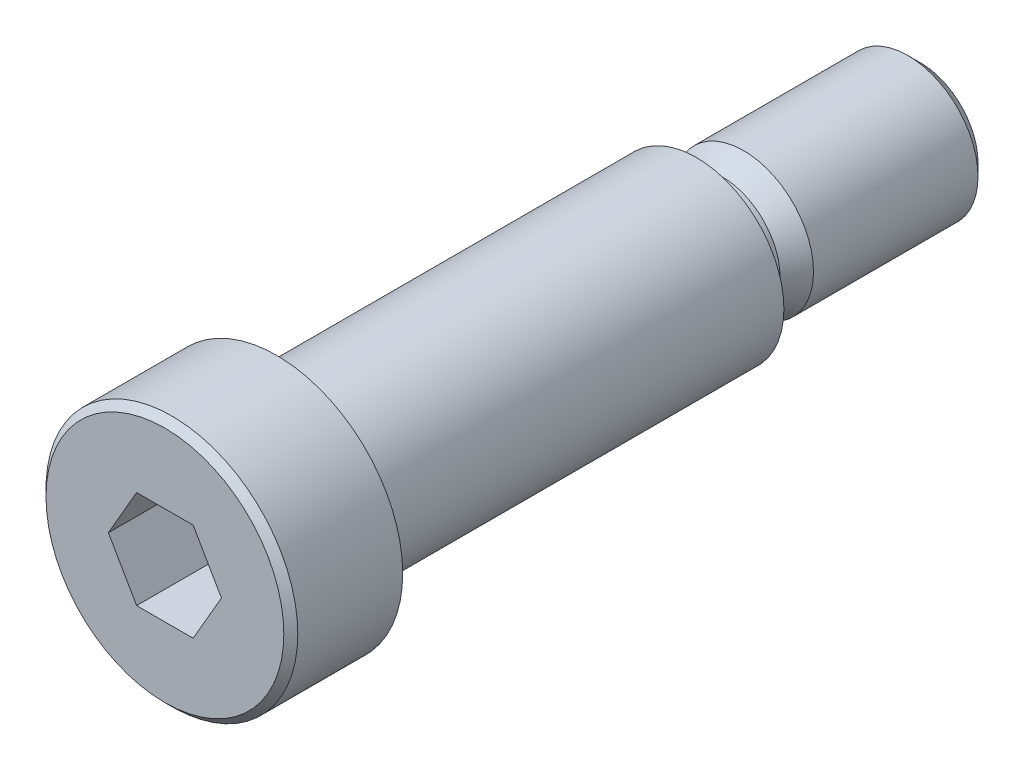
ISO-10303-21;
HEADER;
FILE_DESCRIPTION(('STEP AP214'),'2;1');
FILE_NAME('part.step','',(''),(''),'','','');
FILE_SCHEMA(('AUTOMOTIVE_DESIGN { 1 0 10303 214 1 1 1 1 }'));
ENDSEC;
DATA;
#1=APPLICATION_CONTEXT('core data for automotive mechanical design processes');
#2=APPLICATION_PROTOCOL_DEFINITION('international standard','automotive_design',2000,#1);
#3=PRODUCT_CONTEXT('',#1,'mechanical');
#4=PRODUCT('Part','Part','',(#3));
#5=PRODUCT_RELATED_PRODUCT_CATEGORY('part','',(#4));
#6=PRODUCT_DEFINITION_FORMATION('','',#4);
#7=PRODUCT_DEFINITION_CONTEXT('part definition',#1,'design');
#8=PRODUCT_DEFINITION('design','',#6,#7);
#9=PRODUCT_DEFINITION_SHAPE('','',#8);
#10=(LENGTH_UNIT() NAMED_UNIT(*) SI_UNIT(.MILLI.,.METRE.));
#11=(NAMED_UNIT(*) PLANE_ANGLE_UNIT() SI_UNIT($,.RADIAN.));
#12=(NAMED_UNIT(*) SI_UNIT($,.STERADIAN.) SOLID_ANGLE_UNIT());
#13=UNCERTAINTY_MEASURE_WITH_UNIT(LENGTH_MEASURE(1.E-05),#10,'distance_accuracy_value','');
#14=(GEOMETRIC_REPRESENTATION_CONTEXT(3) GLOBAL_UNCERTAINTY_ASSIGNED_CONTEXT((#13)) GLOBAL_UNIT_ASSIGNED_CONTEXT((#10,
#11,#12)) REPRESENTATION_CONTEXT('',''));
#15=CARTESIAN_POINT('',(0.,0.,0.));
#16=DIRECTION('',(0.,0.,1.));
#17=DIRECTION('',(1.,0.,0.));
#18=AXIS2_PLACEMENT_3D('',#15,#16,#17);
#19=CARTESIAN_POINT('',(0.,0.,16.));
#20=DIRECTION('',(0.,0.,1.));
#21=DIRECTION('',(1.,0.,0.));
#22=AXIS2_PLACEMENT_3D('',#19,#20,#21);
#23=PLANE('',#22);
#24=CARTESIAN_POINT('',(0.,0.,16.));
#25=DIRECTION('',(0.,0.,1.));
#26=DIRECTION('',(1.,0.,0.));
#27=AXIS2_PLACEMENT_3D('',#24,#25,#26);
#28=CIRCLE('',#27,17.);
#29=CARTESIAN_POINT('',(17.,0.,16.));
#30=VERTEX_POINT('',#29);
#31=EDGE_CURVE('E153',#30,#30,#28,.T.);
#32=ORIENTED_EDGE('',*,*,#31,.T.);
#33=EDGE_LOOP('',(#32));
#34=FACE_BOUND('',#33,.T.);
#35=DIRECTION('',(1.,0.,0.));
#36=VECTOR('',#35,1.);
#37=CARTESIAN_POINT('',(-4.04145,6.99999673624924,16.));
#38=LINE('',#37,#36);
#39=CARTESIAN_POINT('',(-4.04145,6.99999673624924,16.));
#40=VERTEX_POINT('',#39);
#41=CARTESIAN_POINT('',(4.04145,6.99999673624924,16.));
#42=VERTEX_POINT('',#41);
#43=EDGE_CURVE('E119',#40,#42,#38,.T.);
#44=ORIENTED_EDGE('',*,*,#43,.T.);
#45=DIRECTION('',(0.5,-0.866025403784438,0.));
#46=VECTOR('',#45,1.);
#47=CARTESIAN_POINT('',(4.04145,6.99999673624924,16.));
#48=LINE('',#47,#46);
#49=CARTESIAN_POINT('',(8.0829,0.,16.));
#50=VERTEX_POINT('',#49);
#51=EDGE_CURVE('E38',#42,#50,#48,.T.);
#52=ORIENTED_EDGE('',*,*,#51,.T.);
#53=DIRECTION('',(-0.5,-0.866025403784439,0.));
#54=VECTOR('',#53,1.);
#55=CARTESIAN_POINT('',(8.0829,0.,16.));
#56=LINE('',#55,#54);
#57=CARTESIAN_POINT('',(4.04145,-6.99999673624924,16.));
#58=VERTEX_POINT('',#57);
#59=EDGE_CURVE('E863',#50,#58,#56,.T.);
#60=ORIENTED_EDGE('',*,*,#59,.T.);
#61=DIRECTION('',(-1.,0.,0.));
#62=VECTOR('',#61,1.);
#63=CARTESIAN_POINT('',(4.04145,-6.99999673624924,16.));
#64=LINE('',#63,#62);
#65=CARTESIAN_POINT('',(-4.04145,-6.99999673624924,16.));
#66=VERTEX_POINT('',#65);
#67=EDGE_CURVE('E867',#58,#66,#64,.T.);
#68=ORIENTED_EDGE('',*,*,#67,.T.);
#69=DIRECTION('',(-0.5,0.866025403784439,0.));
#70=VECTOR('',#69,1.);
#71=CARTESIAN_POINT('',(-4.04145,-6.99999673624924,16.));
#72=LINE('',#71,#70);
#73=CARTESIAN_POINT('',(-8.0829,0.,16.));
#74=VERTEX_POINT('',#73);
#75=EDGE_CURVE('E871',#66,#74,#72,.T.);
#76=ORIENTED_EDGE('',*,*,#75,.T.);
#77=DIRECTION('',(0.5,0.866025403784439,0.));
#78=VECTOR('',#77,1.);
#79=CARTESIAN_POINT('',(-8.0829,0.,16.));
#80=LINE('',#79,#78);
#81=EDGE_CURVE('E126',#74,#40,#80,.T.);
#82=ORIENTED_EDGE('',*,*,#81,.T.);
#83=EDGE_LOOP('',(#44,#52,#60,#68,#76,#82));
#84=FACE_BOUND('',#83,.T.);
#85=ADVANCED_FACE('F17',(#34,#84),#23,.T.);
#86=CARTESIAN_POINT('',(0.,0.,-1.5625));
#87=DIRECTION('',(0.,0.,1.));
#88=DIRECTION('',(1.,0.,0.));
#89=AXIS2_PLACEMENT_3D('',#86,#87,#88);
#90=TOROIDAL_SURFACE('',#89,12.5,1.5625);
#91=CARTESIAN_POINT('',(0.,0.,0.));
#92=DIRECTION('',(0.,0.,1.));
#93=DIRECTION('',(1.,0.,0.));
#94=AXIS2_PLACEMENT_3D('',#91,#92,#93);
#95=CIRCLE('',#94,12.5);
#96=CARTESIAN_POINT('',(12.5,0.,0.));
#97=VERTEX_POINT('',#96);
#98=EDGE_CURVE('E141',#97,#97,#95,.T.);
#99=ORIENTED_EDGE('',*,*,#98,.F.);
#100=EDGE_LOOP('',(#99));
#101=FACE_BOUND('',#100,.T.);
#102=CARTESIAN_POINT('',(0.,0.,-3.125));
#103=DIRECTION('',(0.,0.,1.));
#104=DIRECTION('',(1.,0.,0.));
#105=AXIS2_PLACEMENT_3D('',#102,#103,#104);
#106=CIRCLE('',#105,12.5);
#107=CARTESIAN_POINT('',(12.5,0.,-3.125));
#108=VERTEX_POINT('',#107);
#109=EDGE_CURVE('E11',#108,#108,#106,.T.);
#110=ORIENTED_EDGE('',*,*,#109,.T.);
#111=EDGE_LOOP('',(#110));
#112=FACE_BOUND('',#111,.T.);
#113=ADVANCED_FACE('F19',(#101,#112),#90,.F.);
#114=CARTESIAN_POINT('',(0.,0.,16.));
#115=DIRECTION('',(0.,0.,1.));
#116=DIRECTION('',(1.,0.,0.));
#117=AXIS2_PLACEMENT_3D('',#114,#115,#116);
#118=CYLINDRICAL_SURFACE('',#117,12.5);
#119=CARTESIAN_POINT('',(0.,0.,-60.));
#120=DIRECTION('',(0.,0.,1.));
#121=DIRECTION('',(1.,0.,0.));
#122=AXIS2_PLACEMENT_3D('',#119,#120,#121);
#123=CIRCLE('',#122,12.5);
#124=CARTESIAN_POINT('',(12.5,0.,-60.));
#125=VERTEX_POINT('',#124);
#126=EDGE_CURVE('E26',#125,#125,#123,.T.);
#127=ORIENTED_EDGE('',*,*,#126,.T.);
#128=EDGE_LOOP('',(#127));
#129=FACE_BOUND('',#128,.T.);
#130=ORIENTED_EDGE('',*,*,#109,.F.);
#131=EDGE_LOOP('',(#130));
#132=FACE_BOUND('',#131,.T.);
#133=ADVANCED_FACE('F198',(#129,#132),#118,.T.);
#134=CARTESIAN_POINT('',(0.,-12.5,-60.));
#135=DIRECTION('',(0.,0.,-1.));
#136=DIRECTION('',(-1.,0.,0.));
#137=AXIS2_PLACEMENT_3D('',#134,#135,#136);
#138=PLANE('',#137);
#139=CARTESIAN_POINT('',(0.,0.,-60.));
#140=DIRECTION('',(0.,0.,1.));
#141=DIRECTION('',(1.,0.,0.));
#142=AXIS2_PLACEMENT_3D('',#139,#140,#141);
#143=CIRCLE('',#142,9.45);
#144=CARTESIAN_POINT('',(9.45,0.,-60.));
#145=VERTEX_POINT('',#144);
#146=EDGE_CURVE('E188',#145,#145,#143,.T.);
#147=ORIENTED_EDGE('',*,*,#146,.T.);
#148=EDGE_LOOP('',(#147));
#149=FACE_BOUND('',#148,.T.);
#150=ORIENTED_EDGE('',*,*,#126,.F.);
#151=EDGE_LOOP('',(#150));
#152=FACE_BOUND('',#151,.T.);
#153=ADVANCED_FACE('F201',(#149,#152),#138,.T.);
#154=CARTESIAN_POINT('',(0.,0.,-61.2));
#155=DIRECTION('',(0.,0.,1.));
#156=DIRECTION('',(1.,0.,0.));
#157=AXIS2_PLACEMENT_3D('',#154,#155,#156);
#158=TOROIDAL_SURFACE('',#157,9.45,1.2);
#159=ORIENTED_EDGE('',*,*,#146,.F.);
#160=EDGE_LOOP('',(#159));
#161=FACE_BOUND('',#160,.T.);
#162=CARTESIAN_POINT('',(0.,0.,-61.2));
#163=DIRECTION('',(0.,0.,1.));
#164=DIRECTION('',(1.,0.,0.));
#165=AXIS2_PLACEMENT_3D('',#162,#163,#164);
#166=CIRCLE('',#165,8.25);
#167=CARTESIAN_POINT('',(8.25000000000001,0.,-61.2));
#168=VERTEX_POINT('',#167);
#169=EDGE_CURVE('E184',#168,#168,#166,.T.);
#170=ORIENTED_EDGE('',*,*,#169,.T.);
#171=EDGE_LOOP('',(#170));
#172=FACE_BOUND('',#171,.T.);
#173=ADVANCED_FACE('F203',(#161,#172),#158,.F.);
#174=CARTESIAN_POINT('',(0.,0.,16.));
#175=DIRECTION('',(0.,0.,1.));
#176=DIRECTION('',(1.,0.,0.));
#177=AXIS2_PLACEMENT_3D('',#174,#175,#176);
#178=CYLINDRICAL_SURFACE('',#177,8.25);
#179=CARTESIAN_POINT('',(0.,0.,-63.7));
#180=DIRECTION('',(0.,0.,1.));
#181=DIRECTION('',(1.,0.,0.));
#182=AXIS2_PLACEMENT_3D('',#179,#180,#181);
#183=CIRCLE('',#182,8.25);
#184=CARTESIAN_POINT('',(8.25000000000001,0.,-63.7));
#185=VERTEX_POINT('',#184);
#186=EDGE_CURVE('E180',#185,#185,#183,.T.);
#187=ORIENTED_EDGE('',*,*,#186,.T.);
#188=EDGE_LOOP('',(#187));
#189=FACE_BOUND('',#188,.T.);
#190=ORIENTED_EDGE('',*,*,#169,.F.);
#191=EDGE_LOOP('',(#190));
#192=FACE_BOUND('',#191,.T.);
#193=ADVANCED_FACE('F212',(#189,#192),#178,.T.);
#194=CARTESIAN_POINT('',(0.,0.,-63.7));
#195=DIRECTION('',(0.,0.,-1.));
#196=DIRECTION('',(-1.,0.,0.));
#197=AXIS2_PLACEMENT_3D('',#194,#195,#196);
#198=CONICAL_SURFACE('',#197,8.25,0.523598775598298);
#199=CARTESIAN_POINT('',(0.,0.,-66.7310889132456));
#200=DIRECTION('',(0.,0.,1.));
#201=DIRECTION('',(1.,0.,0.));
#202=AXIS2_PLACEMENT_3D('',#199,#200,#201);
#203=CIRCLE('',#202,10.);
#204=CARTESIAN_POINT('',(10.,0.,-66.7310889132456));
#205=VERTEX_POINT('',#204);
#206=EDGE_CURVE('E176',#205,#205,#203,.T.);
#207=ORIENTED_EDGE('',*,*,#206,.T.);
#208=EDGE_LOOP('',(#207));
#209=FACE_BOUND('',#208,.T.);
#210=ORIENTED_EDGE('',*,*,#186,.F.);
#211=EDGE_LOOP('',(#210));
#212=FACE_BOUND('',#211,.T.);
#213=ADVANCED_FACE('F251',(#209,#212),#198,.T.);
#214=CARTESIAN_POINT('',(0.,0.,16.));
#215=DIRECTION('',(0.,0.,1.));
#216=DIRECTION('',(1.,0.,0.));
#217=AXIS2_PLACEMENT_3D('',#214,#215,#216);
#218=CYLINDRICAL_SURFACE('',#217,10.);
#219=CARTESIAN_POINT('',(0.,0.,-90.25));
#220=DIRECTION('',(0.,0.,1.));
#221=DIRECTION('',(1.,0.,0.));
#222=AXIS2_PLACEMENT_3D('',#219,#220,#221);
#223=CIRCLE('',#222,10.);
#224=CARTESIAN_POINT('',(10.,0.,-90.25));
#225=VERTEX_POINT('',#224);
#226=EDGE_CURVE('E172',#225,#225,#223,.T.);
#227=ORIENTED_EDGE('',*,*,#226,.T.);
#228=EDGE_LOOP('',(#227));
#229=FACE_BOUND('',#228,.T.);
#230=ORIENTED_EDGE('',*,*,#206,.F.);
#231=EDGE_LOOP('',(#230));
#232=FACE_BOUND('',#231,.T.);
#233=ADVANCED_FACE('F247',(#229,#232),#218,.T.);
#234=CARTESIAN_POINT('',(0.,0.,-90.25));
#235=DIRECTION('',(0.,0.,1.));
#236=DIRECTION('',(1.,0.,0.));
#237=AXIS2_PLACEMENT_3D('',#234,#235,#236);
#238=CONICAL_SURFACE('',#237,10.,0.785398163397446);
#239=CARTESIAN_POINT('',(0.,0.,-92.));
#240=DIRECTION('',(0.,0.,1.));
#241=DIRECTION('',(1.,0.,0.));
#242=AXIS2_PLACEMENT_3D('',#239,#240,#241);
#243=CIRCLE('',#242,8.25);
#244=CARTESIAN_POINT('',(8.25000000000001,0.,-92.));
#245=VERTEX_POINT('',#244);
#246=EDGE_CURVE('E168',#245,#245,#243,.T.);
#247=ORIENTED_EDGE('',*,*,#246,.T.);
#248=EDGE_LOOP('',(#247));
#249=FACE_BOUND('',#248,.T.);
#250=ORIENTED_EDGE('',*,*,#226,.F.);
#251=EDGE_LOOP('',(#250));
#252=FACE_BOUND('',#251,.T.);
#253=ADVANCED_FACE('F243',(#249,#252),#238,.T.);
#254=CARTESIAN_POINT('',(0.,-8.25,-92.));
#255=DIRECTION('',(0.,0.,-1.));
#256=DIRECTION('',(-1.,0.,0.));
#257=AXIS2_PLACEMENT_3D('',#254,#255,#256);
#258=PLANE('',#257);
#259=CARTESIAN_POINT('',(0.,0.,-92.));
#260=DIRECTION('',(0.,0.,1.));
#261=DIRECTION('',(1.,0.,0.));
#262=AXIS2_PLACEMENT_3D('',#259,#260,#261);
#263=CIRCLE('',#262,3.09079733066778);
#264=CARTESIAN_POINT('',(3.09079733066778,0.,-92.));
#265=VERTEX_POINT('',#264);
#266=EDGE_CURVE('E164',#265,#265,#263,.T.);
#267=ORIENTED_EDGE('',*,*,#266,.T.);
#268=EDGE_LOOP('',(#267));
#269=FACE_BOUND('',#268,.T.);
#270=ORIENTED_EDGE('',*,*,#246,.F.);
#271=EDGE_LOOP('',(#270));
#272=FACE_BOUND('',#271,.T.);
#273=ADVANCED_FACE('F239',(#269,#272),#258,.T.);
#274=CARTESIAN_POINT('',(0.,0.,-92.));
#275=DIRECTION('',(0.,0.,-1.));
#276=DIRECTION('',(-1.,0.,0.));
#277=AXIS2_PLACEMENT_3D('',#274,#275,#276);
#278=CONICAL_SURFACE('',#277,3.09079733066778,0.5235987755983);
#279=CARTESIAN_POINT('',(0.,0.,-89.5333333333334));
#280=DIRECTION('',(0.,0.,1.));
#281=DIRECTION('',(1.,0.,0.));
#282=AXIS2_PLACEMENT_3D('',#279,#280,#281);
#283=CIRCLE('',#282,1.66666666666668);
#284=CARTESIAN_POINT('',(1.66666666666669,0.,-89.5333333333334));
#285=VERTEX_POINT('',#284);
#286=EDGE_CURVE('E160',#285,#285,#283,.T.);
#287=ORIENTED_EDGE('',*,*,#286,.T.);
#288=EDGE_LOOP('',(#287));
#289=FACE_BOUND('',#288,.T.);
#290=ORIENTED_EDGE('',*,*,#266,.F.);
#291=EDGE_LOOP('',(#290));
#292=FACE_BOUND('',#291,.T.);
#293=ADVANCED_FACE('F235',(#289,#292),#278,.F.);
#294=CARTESIAN_POINT('',(0.,0.,16.));
#295=DIRECTION('',(0.,0.,1.));
#296=DIRECTION('',(1.,0.,0.));
#297=AXIS2_PLACEMENT_3D('',#294,#295,#296);
#298=CYLINDRICAL_SURFACE('',#297,1.66666666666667);
#299=CARTESIAN_POINT('',(0.,0.,-85.9399503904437));
#300=DIRECTION('',(0.,0.,1.));
#301=DIRECTION('',(1.,0.,0.));
#302=AXIS2_PLACEMENT_3D('',#299,#300,#301);
#303=CIRCLE('',#302,1.66666666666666);
#304=CARTESIAN_POINT('',(1.66666666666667,0.,-85.9399503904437));
#305=VERTEX_POINT('',#304);
#306=EDGE_CURVE('E156',#305,#305,#303,.T.);
#307=ORIENTED_EDGE('',*,*,#306,.T.);
#308=EDGE_LOOP('',(#307));
#309=FACE_BOUND('',#308,.T.);
#310=ORIENTED_EDGE('',*,*,#286,.F.);
#311=EDGE_LOOP('',(#310));
#312=FACE_BOUND('',#311,.T.);
#313=ADVANCED_FACE('F232',(#309,#312),#298,.F.);
#314=CARTESIAN_POINT('',(0.,0.,-85.9399503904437));
#315=DIRECTION('',(0.,0.,-1.));
#316=DIRECTION('',(-1.,0.,0.));
#317=AXIS2_PLACEMENT_3D('',#314,#315,#316);
#318=CONICAL_SURFACE('',#317,1.66666666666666,1.22173047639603);
#319=CARTESIAN_POINT('',(0.,0.,-85.3333333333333));
#320=VERTEX_POINT('',#319);
#321=VERTEX_LOOP('',#320);
#322=FACE_BOUND('',#321,.T.);
#323=ORIENTED_EDGE('',*,*,#306,.F.);
#324=EDGE_LOOP('',(#323));
#325=FACE_BOUND('',#324,.T.);
#326=ADVANCED_FACE('F229',(#322,#325),#318,.F.);
#327=CARTESIAN_POINT('',(0.,0.,16.));
#328=DIRECTION('',(0.,0.,-1.));
#329=DIRECTION('',(-1.,0.,0.));
#330=AXIS2_PLACEMENT_3D('',#327,#328,#329);
#331=CONICAL_SURFACE('',#330,17.,0.785398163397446);
#332=CARTESIAN_POINT('',(0.,0.,15.));
#333=DIRECTION('',(0.,0.,1.));
#334=DIRECTION('',(1.,0.,0.));
#335=AXIS2_PLACEMENT_3D('',#332,#333,#334);
#336=CIRCLE('',#335,18.);
#337=CARTESIAN_POINT('',(18.,0.,15.));
#338=VERTEX_POINT('',#337);
#339=EDGE_CURVE('E149',#338,#338,#336,.T.);
#340=ORIENTED_EDGE('',*,*,#339,.T.);
#341=EDGE_LOOP('',(#340));
#342=FACE_BOUND('',#341,.T.);
#343=ORIENTED_EDGE('',*,*,#31,.F.);
#344=EDGE_LOOP('',(#343));
#345=FACE_BOUND('',#344,.T.);
#346=ADVANCED_FACE('F227',(#342,#345),#331,.T.);
#347=CARTESIAN_POINT('',(0.,0.,16.));
#348=DIRECTION('',(0.,0.,1.));
#349=DIRECTION('',(1.,0.,0.));
#350=AXIS2_PLACEMENT_3D('',#347,#348,#349);
#351=CYLINDRICAL_SURFACE('',#350,18.);
#352=CARTESIAN_POINT('',(0.,0.,0.));
#353=DIRECTION('',(0.,0.,1.));
#354=DIRECTION('',(1.,0.,0.));
#355=AXIS2_PLACEMENT_3D('',#352,#353,#354);
#356=CIRCLE('',#355,18.);
#357=CARTESIAN_POINT('',(18.,0.,0.));
#358=VERTEX_POINT('',#357);
#359=EDGE_CURVE('E145',#358,#358,#356,.T.);
#360=ORIENTED_EDGE('',*,*,#359,.T.);
#361=EDGE_LOOP('',(#360));
#362=FACE_BOUND('',#361,.T.);
#363=ORIENTED_EDGE('',*,*,#339,.F.);
#364=EDGE_LOOP('',(#363));
#365=FACE_BOUND('',#364,.T.);
#366=ADVANCED_FACE('F321',(#362,#365),#351,.T.);
#367=CARTESIAN_POINT('',(0.,-18.,0.));
#368=DIRECTION('',(0.,0.,-1.));
#369=DIRECTION('',(-1.,0.,0.));
#370=AXIS2_PLACEMENT_3D('',#367,#368,#369);
#371=PLANE('',#370);
#372=ORIENTED_EDGE('',*,*,#98,.T.);
#373=EDGE_LOOP('',(#372));
#374=FACE_BOUND('',#373,.T.);
#375=ORIENTED_EDGE('',*,*,#359,.F.);
#376=EDGE_LOOP('',(#375));
#377=FACE_BOUND('',#376,.T.);
#378=ADVANCED_FACE('F330',(#374,#377),#371,.T.);
#379=CARTESIAN_POINT('',(4.04145,6.99999673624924,0.333335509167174));
#380=DIRECTION('',(-0.866025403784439,-0.5,0.));
#381=DIRECTION('',(-0.5,0.866025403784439,0.));
#382=AXIS2_PLACEMENT_3D('',#379,#380,#381);
#383=PLANE('',#382);
#384=DIRECTION('',(0.,0.,1.));
#385=VECTOR('',#384,1.);
#386=CARTESIAN_POINT('',(8.0829,0.,0.333335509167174));
#387=LINE('',#386,#385);
#388=CARTESIAN_POINT('',(8.0829,0.,5.));
#389=VERTEX_POINT('',#388);
#390=EDGE_CURVE('E138',#389,#50,#387,.T.);
#391=ORIENTED_EDGE('',*,*,#390,.T.);
#392=ORIENTED_EDGE('',*,*,#51,.F.);
#393=DIRECTION('',(0.,0.,1.));
#394=VECTOR('',#393,1.);
#395=CARTESIAN_POINT('',(4.04145,6.99999673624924,0.333335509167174));
#396=LINE('',#395,#394);
#397=CARTESIAN_POINT('',(4.04145,6.99999673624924,5.));
#398=VERTEX_POINT('',#397);
#399=EDGE_CURVE('E112',#398,#42,#396,.T.);
#400=ORIENTED_EDGE('',*,*,#399,.F.);
#401=CARTESIAN_POINT('',(8.08290115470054,-2.E-06,5.00000066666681));
#402=CARTESIAN_POINT('',(7.99406648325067,0.153864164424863,4.94872181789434));
#403=CARTESIAN_POINT('',(7.90490059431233,0.308304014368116,4.89977038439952));
#404=CARTESIAN_POINT('',(7.72584470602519,0.618437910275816,4.80716333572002));
#405=CARTESIAN_POINT('',(7.63595441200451,0.774132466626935,4.76351000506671));
#406=CARTESIAN_POINT('',(7.36484437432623,1.24370882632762,4.64135409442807));
#407=CARTESIAN_POINT('',(7.18255450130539,1.559444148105,4.57187428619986));
#408=CARTESIAN_POINT('',(6.90976104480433,2.03193627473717,4.49040295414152));
#409=CARTESIAN_POINT('',(6.82007246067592,2.18728145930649,4.46719451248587));
#410=CARTESIAN_POINT('',(6.64029009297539,2.49867365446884,4.42827826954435));
#411=CARTESIAN_POINT('',(6.55019634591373,2.6547206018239,4.41256980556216));
#412=CARTESIAN_POINT('',(6.36985242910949,2.96708542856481,4.38905385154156));
#413=CARTESIAN_POINT('',(6.27960255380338,3.12340279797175,4.38123739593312));
#414=CARTESIAN_POINT('',(6.0990244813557,3.43617319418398,4.37366467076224));
#415=CARTESIAN_POINT('',(6.00869628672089,3.59262621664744,4.37390815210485));
#416=CARTESIAN_POINT('',(5.76124184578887,4.02122988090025,4.38565325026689));
#417=CARTESIAN_POINT('',(5.60419664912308,4.29324014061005,4.4053603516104));
#418=CARTESIAN_POINT('',(5.29114930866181,4.83545403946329,4.46784506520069));
#419=CARTESIAN_POINT('',(5.13514826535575,5.10565577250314,4.51064402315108));
#420=CARTESIAN_POINT('',(4.82147120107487,5.64896038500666,4.61762637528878));
#421=CARTESIAN_POINT('',(4.66383474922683,5.92199472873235,4.68226292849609));
#422=CARTESIAN_POINT('',(4.35091230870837,6.46399229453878,4.82896081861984));
#423=CARTESIAN_POINT('',(4.19562231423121,6.73296245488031,4.91098770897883));
#424=CARTESIAN_POINT('',(4.04144884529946,6.99999873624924,5.00000066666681));
#425=B_SPLINE_CURVE_WITH_KNOTS('',3,(#401,#402,#403,#404,#405,#406,#407,#408,#409,#410,#411,
#412,#413,#414,#415,#416,#417,#418,#419,#420,#421,#422,#423,#424),.UNSPECIFIED.,.F.,.F.,(4,2,2,
2,2,2,2,2,2,2,2,4),(0.,0.554719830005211,1.10967801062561,2.22189997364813,2.76439031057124,
3.30683270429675,3.84865817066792,4.3904668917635,5.33360160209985,6.27760962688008,
7.24255125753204,8.20559910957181),.UNSPECIFIED.);
#426=EDGE_CURVE('E103',#389,#398,#425,.T.);
#427=ORIENTED_EDGE('',*,*,#426,.F.);
#428=EDGE_LOOP('',(#391,#392,#400,#427));
#429=FACE_BOUND('',#428,.T.);
#430=ADVANCED_FACE('F113',(#429),#383,.T.);
#431=CARTESIAN_POINT('',(8.0829,0.,0.333335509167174));
#432=DIRECTION('',(-0.866025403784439,0.5,0.));
#433=DIRECTION('',(0.5,0.866025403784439,0.));
#434=AXIS2_PLACEMENT_3D('',#431,#432,#433);
#435=PLANE('',#434);
#436=DIRECTION('',(0.,0.,1.));
#437=VECTOR('',#436,1.);
#438=CARTESIAN_POINT('',(4.04145,-6.99999673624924,0.333335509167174));
#439=LINE('',#438,#437);
#440=CARTESIAN_POINT('',(4.04145,-6.99999673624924,5.));
#441=VERTEX_POINT('',#440);
#442=EDGE_CURVE('E135',#441,#58,#439,.T.);
#443=ORIENTED_EDGE('',*,*,#442,.T.);
#444=ORIENTED_EDGE('',*,*,#59,.F.);
#445=ORIENTED_EDGE('',*,*,#390,.F.);
#446=CARTESIAN_POINT('',(4.04144884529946,-6.99999873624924,5.00000066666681));
#447=CARTESIAN_POINT('',(4.13028351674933,-6.84613257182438,4.94872181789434));
#448=CARTESIAN_POINT('',(4.21944940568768,-6.69169272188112,4.89977038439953));
#449=CARTESIAN_POINT('',(4.39850529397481,-6.38155882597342,4.80716333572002));
#450=CARTESIAN_POINT('',(4.48839558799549,-6.2258642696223,4.76351000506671));
#451=CARTESIAN_POINT('',(4.75950562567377,-5.75628790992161,4.64135409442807));
#452=CARTESIAN_POINT('',(4.94179549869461,-5.44055258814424,4.57187428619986));
#453=CARTESIAN_POINT('',(5.21458895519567,-4.96806046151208,4.49040295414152));
#454=CARTESIAN_POINT('',(5.30427753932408,-4.81271527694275,4.46719451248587));
#455=CARTESIAN_POINT('',(5.48405990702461,-4.5013230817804,4.42827826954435));
#456=CARTESIAN_POINT('',(5.57415365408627,-4.34527613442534,4.41256980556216));
#457=CARTESIAN_POINT('',(5.75449757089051,-4.03291130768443,4.38905385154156));
#458=CARTESIAN_POINT('',(5.84474744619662,-3.87659393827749,4.38123739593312));
#459=CARTESIAN_POINT('',(6.0253255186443,-3.56382354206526,4.37366467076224));
#460=CARTESIAN_POINT('',(6.11565371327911,-3.4073705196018,4.37390815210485));
#461=CARTESIAN_POINT('',(6.36310815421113,-2.97876685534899,4.38565325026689));
#462=CARTESIAN_POINT('',(6.52015335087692,-2.70675659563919,4.4053603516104));
#463=CARTESIAN_POINT('',(6.83320069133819,-2.16454269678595,4.46784506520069));
#464=CARTESIAN_POINT('',(6.98920173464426,-1.8943409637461,4.51064402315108));
#465=CARTESIAN_POINT('',(7.30287879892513,-1.35103635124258,4.61762637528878));
#466=CARTESIAN_POINT('',(7.46051525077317,-1.07800200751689,4.68226292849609));
#467=CARTESIAN_POINT('',(7.77343769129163,-0.536004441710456,4.82896081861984));
#468=CARTESIAN_POINT('',(7.92872768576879,-0.267034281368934,4.91098770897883));
#469=CARTESIAN_POINT('',(8.08290115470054,1.99999999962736E-06,5.00000066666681));
#470=B_SPLINE_CURVE_WITH_KNOTS('',3,(#446,#447,#448,#449,#450,#451,#452,#453,#454,#455,#456,
#457,#458,#459,#460,#461,#462,#463,#464,#465,#466,#467,#468,#469),.UNSPECIFIED.,.F.,.F.,(4,2,2,
2,2,2,2,2,2,2,2,4),(0.,0.554719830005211,1.10967801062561,2.22189997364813,2.76439031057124,
3.30683270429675,3.84865817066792,4.39046689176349,5.33360160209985,6.27760962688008,
7.24255125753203,8.20559910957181),.UNSPECIFIED.);
#471=EDGE_CURVE('E108',#441,#389,#470,.T.);
#472=ORIENTED_EDGE('',*,*,#471,.F.);
#473=EDGE_LOOP('',(#443,#444,#445,#472));
#474=FACE_BOUND('',#473,.T.);
#475=ADVANCED_FACE('F348',(#474),#435,.T.);
#476=CARTESIAN_POINT('',(4.04145,-6.99999673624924,0.333335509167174));
#477=DIRECTION('',(0.,1.,0.));
#478=DIRECTION('',(1.,0.,0.));
#479=AXIS2_PLACEMENT_3D('',#476,#477,#478);
#480=PLANE('',#479);
#481=DIRECTION('',(0.,0.,1.));
#482=VECTOR('',#481,1.);
#483=CARTESIAN_POINT('',(-4.04145,-6.99999673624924,0.333335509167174));
#484=LINE('',#483,#482);
#485=CARTESIAN_POINT('',(-4.04145,-6.99999673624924,5.));
#486=VERTEX_POINT('',#485);
#487=EDGE_CURVE('E132',#486,#66,#484,.T.);
#488=ORIENTED_EDGE('',*,*,#487,.T.);
#489=ORIENTED_EDGE('',*,*,#67,.F.);
#490=ORIENTED_EDGE('',*,*,#442,.F.);
#491=CARTESIAN_POINT('',(-10.4660109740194,-6.99999673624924,7.60284580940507));
#492=CARTESIAN_POINT('',(-10.1637269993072,-6.99999673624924,7.45782139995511));
#493=CARTESIAN_POINT('',(-9.86070662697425,-6.99999673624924,7.31430332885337));
#494=CARTESIAN_POINT('',(-9.2528005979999,-6.99999673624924,7.03113439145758));
#495=CARTESIAN_POINT('',(-8.94791461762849,-6.99999673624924,6.89148422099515));
#496=CARTESIAN_POINT('',(-8.33413673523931,-6.99999673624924,6.61612544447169));
#497=CARTESIAN_POINT('',(-8.02523175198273,-6.99999673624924,6.48044588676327));
#498=CARTESIAN_POINT('',(-7.40482970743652,-6.99999673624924,6.21517096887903));
#499=CARTESIAN_POINT('',(-7.09333278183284,-6.99999673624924,6.08557529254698));
#500=CARTESIAN_POINT('',(-6.4590456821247,-6.99999673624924,5.83078821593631));
#501=CARTESIAN_POINT('',(-6.13617317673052,-6.99999673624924,5.70580055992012));
#502=CARTESIAN_POINT('',(-5.48652368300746,-6.99999673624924,5.46621670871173));
#503=CARTESIAN_POINT('',(-5.15974624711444,-6.99999673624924,5.35162171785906));
#504=CARTESIAN_POINT('',(-4.50250315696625,-6.99999673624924,5.13609609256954));
#505=CARTESIAN_POINT('',(-4.17204779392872,-6.99999673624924,5.03513443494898));
#506=CARTESIAN_POINT('',(-3.50644237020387,-6.99999673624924,4.85034034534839));
#507=CARTESIAN_POINT('',(-3.17129392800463,-6.99999673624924,4.76650215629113));
#508=CARTESIAN_POINT('',(-2.49689993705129,-6.99999673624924,4.6204180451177));
#509=CARTESIAN_POINT('',(-2.15766406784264,-6.99999673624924,4.55812870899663));
#510=CARTESIAN_POINT('',(-1.64604254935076,-6.99999673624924,4.48392112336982));
#511=CARTESIAN_POINT('',(-1.47502545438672,-6.99999673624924,4.46238860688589));
#512=CARTESIAN_POINT('',(-1.13227399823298,-6.99999673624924,4.42616029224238));
#513=CARTESIAN_POINT('',(-0.960539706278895,-6.99999673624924,4.41146384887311));
#514=CARTESIAN_POINT('',(-0.618654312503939,-6.99999673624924,4.38936696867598));
#515=CARTESIAN_POINT('',(-0.448508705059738,-6.99999673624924,4.38188174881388));
#516=CARTESIAN_POINT('',(-0.108054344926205,-6.99999673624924,4.37407394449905));
#517=CARTESIAN_POINT('',(0.0622544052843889,-6.99999673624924,4.37375125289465));
#518=CARTESIAN_POINT('',(0.402740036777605,-6.99999673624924,4.3802769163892));
#519=CARTESIAN_POINT('',(0.572916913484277,-6.99999673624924,4.38712551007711));
#520=CARTESIAN_POINT('',(0.912846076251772,-6.99999673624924,4.40783579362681));
#521=CARTESIAN_POINT('',(1.082598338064,-6.99999673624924,4.42169787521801));
#522=CARTESIAN_POINT('',(1.50233038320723,-6.99999673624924,4.46436831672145));
#523=CARTESIAN_POINT('',(1.75191207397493,-6.99999673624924,4.49715292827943));
#524=CARTESIAN_POINT('',(2.2489711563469,-6.99999673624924,4.57600137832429));
#525=CARTESIAN_POINT('',(2.49644820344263,-6.99999673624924,4.62206734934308));
#526=CARTESIAN_POINT('',(2.98914518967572,-6.99999673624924,4.72583921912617));
#527=CARTESIAN_POINT('',(3.23436304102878,-6.99999673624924,4.78355493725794));
#528=CARTESIAN_POINT('',(3.72222383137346,-6.99999673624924,4.90889246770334));
#529=CARTESIAN_POINT('',(3.96486683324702,-6.99999673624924,4.97651403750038));
#530=CARTESIAN_POINT('',(4.45307336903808,-6.99999673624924,5.12169118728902));
#531=CARTESIAN_POINT('',(4.69858039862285,-6.99999673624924,5.19943551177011));
#532=CARTESIAN_POINT('',(5.18717546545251,-6.99999673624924,5.36214979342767));
#533=CARTESIAN_POINT('',(5.43026348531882,-6.99999673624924,5.44711980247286));
#534=CARTESIAN_POINT('',(5.91415786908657,-6.99999673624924,5.62300757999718));
#535=CARTESIAN_POINT('',(6.15496511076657,-6.99999673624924,5.713922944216));
#536=CARTESIAN_POINT('',(6.63463640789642,-6.99999673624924,5.90071172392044));
#537=CARTESIAN_POINT('',(6.87350049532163,-6.99999673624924,5.99658505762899));
#538=CARTESIAN_POINT('',(7.483230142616,-6.99999673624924,6.24745784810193));
#539=CARTESIAN_POINT('',(7.85287588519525,-6.99999673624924,6.40541911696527));
#540=CARTESIAN_POINT('',(8.58883735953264,-6.99999673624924,6.72894016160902));
#541=CARTESIAN_POINT('',(8.95515283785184,-6.99999673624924,6.89450050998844));
#542=CARTESIAN_POINT('',(9.68517373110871,-6.99999673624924,7.23151164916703));
#543=CARTESIAN_POINT('',(10.048878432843,-6.99999673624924,7.40296398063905));
#544=CARTESIAN_POINT('',(10.77408344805,-6.99999673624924,7.75043152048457));
#545=CARTESIAN_POINT('',(11.1355838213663,-6.99999673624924,7.92644660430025));
#546=CARTESIAN_POINT('',(11.8572308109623,-6.99999673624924,8.28231073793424));
#547=CARTESIAN_POINT('',(12.2173752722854,-6.99999673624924,8.46216415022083));
#548=CARTESIAN_POINT('',(12.9361904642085,-6.99999673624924,8.82479253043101));
#549=CARTESIAN_POINT('',(13.2948611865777,-6.99999673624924,9.00756751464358));
#550=CARTESIAN_POINT('',(14.3689456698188,-6.99999673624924,9.55937103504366));
#551=CARTESIAN_POINT('',(15.0825432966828,-6.99999673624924,9.93193360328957));
#552=CARTESIAN_POINT('',(16.4391457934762,-6.99999673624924,10.6480147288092));
#553=CARTESIAN_POINT('',(17.0824567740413,-6.99999673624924,10.9909558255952));
#554=CARTESIAN_POINT('',(18.3670121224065,-6.99999673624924,11.6807499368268));
#555=CARTESIAN_POINT('',(19.0082564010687,-6.99999673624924,12.0276031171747));
#556=CARTESIAN_POINT('',(20.2875218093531,-6.99999673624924,12.7233504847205));
#557=CARTESIAN_POINT('',(20.9255469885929,-6.99999673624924,13.072237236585));
#558=CARTESIAN_POINT('',(22.2003039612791,-6.99999673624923,13.7722796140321));
#559=CARTESIAN_POINT('',(22.837035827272,-6.99999673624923,14.1234351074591));
#560=CARTESIAN_POINT('',(23.4733041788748,-6.99999673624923,14.4754235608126));
#561=B_SPLINE_CURVE_WITH_KNOTS('',3,(#491,#492,#493,#494,#495,#496,#497,#498,#499,#500,#501,
#502,#503,#504,#505,#506,#507,#508,#509,#510,#511,#512,#513,#514,#515,#516,#517,#518,#519,#520,
#521,#522,#523,#524,#525,#526,#527,#528,#529,#530,#531,#532,#533,#534,#535,#536,#537,#538,#539,
#540,#541,#542,#543,#544,#545,#546,#547,#548,#549,#550,#551,#552,#553,#554,#555,#556,#557,#558,
#559,#560),.UNSPECIFIED.,.F.,.F.,(4,2,2,2,2,2,2,2,2,2,2,2,2,2,2,2,2,2,2,2,2,2,2,2,2,2,2,2,2,2,2,
2,2,2,4),(0.,1.00583192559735,2.01184363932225,3.02395785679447,4.03601942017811,
5.07454204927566,6.11318487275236,7.14942289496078,8.18531194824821,9.21910169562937,
9.73608835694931,10.2530262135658,10.7638094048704,11.2745849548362,11.7853774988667,
12.2961985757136,13.0509501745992,13.8058230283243,14.5613348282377,15.3168281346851,
16.0892611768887,16.8616997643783,17.6338278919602,18.4059432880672,19.6117659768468,
20.817679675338,22.0239111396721,23.2301097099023,24.4377610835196,25.6454191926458,
28.0603617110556,30.2473818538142,32.4344950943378,34.6160453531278,36.7974696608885),.UNSPECIFIED.);
#562=EDGE_CURVE('E816',#486,#441,#561,.T.);
#563=ORIENTED_EDGE('',*,*,#562,.F.);
#564=EDGE_LOOP('',(#488,#489,#490,#563));
#565=FACE_BOUND('',#564,.T.);
#566=ADVANCED_FACE('F357',(#565),#480,.T.);
#567=CARTESIAN_POINT('',(-4.04145,-6.99999673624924,0.333335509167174));
#568=DIRECTION('',(0.866025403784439,0.5,0.));
#569=DIRECTION('',(0.5,-0.866025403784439,0.));
#570=AXIS2_PLACEMENT_3D('',#567,#568,#569);
#571=PLANE('',#570);
#572=DIRECTION('',(0.,0.,1.));
#573=VECTOR('',#572,1.);
#574=CARTESIAN_POINT('',(-8.0829,0.,0.333335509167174));
#575=LINE('',#574,#573);
#576=CARTESIAN_POINT('',(-8.0829,0.,5.));
#577=VERTEX_POINT('',#576);
#578=EDGE_CURVE('E123',#577,#74,#575,.T.);
#579=ORIENTED_EDGE('',*,*,#578,.T.);
#580=ORIENTED_EDGE('',*,*,#75,.F.);
#581=ORIENTED_EDGE('',*,*,#487,.F.);
#582=CARTESIAN_POINT('',(-8.08290115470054,1.99999999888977E-06,5.00000066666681));
#583=CARTESIAN_POINT('',(-7.99406648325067,-0.153864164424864,4.94872181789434));
#584=CARTESIAN_POINT('',(-7.90490059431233,-0.308304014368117,4.89977038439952));
#585=CARTESIAN_POINT('',(-7.72584470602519,-0.618437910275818,4.80716333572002));
#586=CARTESIAN_POINT('',(-7.63595441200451,-0.774132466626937,4.76351000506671));
#587=CARTESIAN_POINT('',(-7.36484437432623,-1.24370882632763,4.64135409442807));
#588=CARTESIAN_POINT('',(-7.18255450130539,-1.559444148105,4.57187428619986));
#589=CARTESIAN_POINT('',(-6.90976104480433,-2.03193627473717,4.49040295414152));
#590=CARTESIAN_POINT('',(-6.82007246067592,-2.18728145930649,4.46719451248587));
#591=CARTESIAN_POINT('',(-6.64029009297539,-2.49867365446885,4.42827826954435));
#592=CARTESIAN_POINT('',(-6.55019634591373,-2.6547206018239,4.41256980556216));
#593=CARTESIAN_POINT('',(-6.36985242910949,-2.96708542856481,4.38905385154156));
#594=CARTESIAN_POINT('',(-6.27960255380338,-3.12340279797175,4.38123739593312));
#595=CARTESIAN_POINT('',(-6.0990244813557,-3.43617319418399,4.37366467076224));
#596=CARTESIAN_POINT('',(-6.00869628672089,-3.59262621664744,4.37390815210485));
#597=CARTESIAN_POINT('',(-5.76124184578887,-4.02122988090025,4.38565325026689));
#598=CARTESIAN_POINT('',(-5.60419664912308,-4.29324014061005,4.4053603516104));
#599=CARTESIAN_POINT('',(-5.29114930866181,-4.83545403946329,4.46784506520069));
#600=CARTESIAN_POINT('',(-5.13514826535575,-5.10565577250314,4.51064402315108));
#601=CARTESIAN_POINT('',(-4.82147120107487,-5.64896038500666,4.61762637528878));
#602=CARTESIAN_POINT('',(-4.66383474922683,-5.92199472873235,4.68226292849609));
#603=CARTESIAN_POINT('',(-4.35091230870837,-6.46399229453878,4.82896081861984));
#604=CARTESIAN_POINT('',(-4.19562231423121,-6.73296245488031,4.91098770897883));
#605=CARTESIAN_POINT('',(-4.04144884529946,-6.99999873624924,5.00000066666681));
#606=B_SPLINE_CURVE_WITH_KNOTS('',3,(#582,#583,#584,#585,#586,#587,#588,#589,#590,#591,#592,
#593,#594,#595,#596,#597,#598,#599,#600,#601,#602,#603,#604,#605),.UNSPECIFIED.,.F.,.F.,(4,2,2,
2,2,2,2,2,2,2,2,4),(0.,0.554719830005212,1.10967801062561,2.22189997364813,2.76439031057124,
3.30683270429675,3.84865817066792,4.39046689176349,5.33360160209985,6.27760962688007,
7.24255125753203,8.20559910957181),.UNSPECIFIED.);
#607=EDGE_CURVE('E821',#577,#486,#606,.T.);
#608=ORIENTED_EDGE('',*,*,#607,.F.);
#609=EDGE_LOOP('',(#579,#580,#581,#608));
#610=FACE_BOUND('',#609,.T.);
#611=ADVANCED_FACE('F367',(#610),#571,.T.);
#612=CARTESIAN_POINT('',(-8.0829,0.,0.333335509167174));
#613=DIRECTION('',(0.866025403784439,-0.5,0.));
#614=DIRECTION('',(-0.5,-0.866025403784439,0.));
#615=AXIS2_PLACEMENT_3D('',#612,#613,#614);
#616=PLANE('',#615);
#617=DIRECTION('',(0.,0.,1.));
#618=VECTOR('',#617,1.);
#619=CARTESIAN_POINT('',(-4.04145,6.99999673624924,0.333335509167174));
#620=LINE('',#619,#618);
#621=CARTESIAN_POINT('',(-4.04145,6.99999673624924,5.));
#622=VERTEX_POINT('',#621);
#623=EDGE_CURVE('E118',#622,#40,#620,.T.);
#624=ORIENTED_EDGE('',*,*,#623,.T.);
#625=ORIENTED_EDGE('',*,*,#81,.F.);
#626=ORIENTED_EDGE('',*,*,#578,.F.);
#627=CARTESIAN_POINT('',(-4.04144884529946,6.99999873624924,5.00000066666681));
#628=CARTESIAN_POINT('',(-4.13028351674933,6.84613257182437,4.94872181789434));
#629=CARTESIAN_POINT('',(-4.21944940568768,6.69169272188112,4.89977038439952));
#630=CARTESIAN_POINT('',(-4.39850529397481,6.38155882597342,4.80716333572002));
#631=CARTESIAN_POINT('',(-4.48839558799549,6.2258642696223,4.76351000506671));
#632=CARTESIAN_POINT('',(-4.75950562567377,5.75628790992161,4.64135409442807));
#633=CARTESIAN_POINT('',(-4.94179549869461,5.44055258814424,4.57187428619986));
#634=CARTESIAN_POINT('',(-5.21458895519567,4.96806046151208,4.49040295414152));
#635=CARTESIAN_POINT('',(-5.30427753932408,4.81271527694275,4.46719451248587));
#636=CARTESIAN_POINT('',(-5.48405990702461,4.5013230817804,4.42827826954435));
#637=CARTESIAN_POINT('',(-5.57415365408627,4.34527613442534,4.41256980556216));
#638=CARTESIAN_POINT('',(-5.75449757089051,4.03291130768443,4.38905385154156));
#639=CARTESIAN_POINT('',(-5.84474744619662,3.87659393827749,4.38123739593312));
#640=CARTESIAN_POINT('',(-6.0253255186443,3.56382354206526,4.37366467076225));
#641=CARTESIAN_POINT('',(-6.11565371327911,3.4073705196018,4.37390815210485));
#642=CARTESIAN_POINT('',(-6.36310815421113,2.97876685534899,4.38565325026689));
#643=CARTESIAN_POINT('',(-6.52015335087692,2.70675659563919,4.4053603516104));
#644=CARTESIAN_POINT('',(-6.83320069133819,2.16454269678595,4.46784506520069));
#645=CARTESIAN_POINT('',(-6.98920173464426,1.8943409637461,4.51064402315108));
#646=CARTESIAN_POINT('',(-7.30287879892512,1.35103635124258,4.61762637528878));
#647=CARTESIAN_POINT('',(-7.46051525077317,1.07800200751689,4.68226292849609));
#648=CARTESIAN_POINT('',(-7.77343769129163,0.536004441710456,4.82896081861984));
#649=CARTESIAN_POINT('',(-7.92872768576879,0.267034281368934,4.91098770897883));
#650=CARTESIAN_POINT('',(-8.08290115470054,-1.99999999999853E-06,5.00000066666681));
#651=B_SPLINE_CURVE_WITH_KNOTS('',3,(#627,#628,#629,#630,#631,#632,#633,#634,#635,#636,#637,
#638,#639,#640,#641,#642,#643,#644,#645,#646,#647,#648,#649,#650),.UNSPECIFIED.,.F.,.F.,(4,2,2,
2,2,2,2,2,2,2,2,4),(0.,0.554719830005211,1.10967801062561,2.22189997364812,2.76439031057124,
3.30683270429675,3.84865817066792,4.39046689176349,5.33360160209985,6.27760962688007,
7.24255125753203,8.20559910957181),.UNSPECIFIED.);
#652=EDGE_CURVE('E824',#622,#577,#651,.T.);
#653=ORIENTED_EDGE('',*,*,#652,.F.);
#654=EDGE_LOOP('',(#624,#625,#626,#653));
#655=FACE_BOUND('',#654,.T.);
#656=ADVANCED_FACE('F377',(#655),#616,.T.);
#657=CARTESIAN_POINT('',(-4.04145,6.99999673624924,0.333335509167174));
#658=DIRECTION('',(0.,-1.,0.));
#659=DIRECTION('',(-1.,0.,0.));
#660=AXIS2_PLACEMENT_3D('',#657,#658,#659);
#661=PLANE('',#660);
#662=ORIENTED_EDGE('',*,*,#399,.T.);
#663=ORIENTED_EDGE('',*,*,#43,.F.);
#664=ORIENTED_EDGE('',*,*,#623,.F.);
#665=CARTESIAN_POINT('',(-10.4660109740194,6.99999673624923,7.60284580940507));
#666=CARTESIAN_POINT('',(-10.1637269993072,6.99999673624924,7.45782139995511));
#667=CARTESIAN_POINT('',(-9.86070662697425,6.99999673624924,7.31430332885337));
#668=CARTESIAN_POINT('',(-9.2528005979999,6.99999673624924,7.03113439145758));
#669=CARTESIAN_POINT('',(-8.94791461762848,6.99999673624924,6.89148422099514));
#670=CARTESIAN_POINT('',(-8.33413673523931,6.99999673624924,6.61612544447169));
#671=CARTESIAN_POINT('',(-8.02523175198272,6.99999673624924,6.48044588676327));
#672=CARTESIAN_POINT('',(-7.40482970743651,6.99999673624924,6.21517096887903));
#673=CARTESIAN_POINT('',(-7.09333278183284,6.99999673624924,6.08557529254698));
#674=CARTESIAN_POINT('',(-6.4590456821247,6.99999673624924,5.8307882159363));
#675=CARTESIAN_POINT('',(-6.13617317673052,6.99999673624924,5.70580055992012));
#676=CARTESIAN_POINT('',(-5.48652368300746,6.99999673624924,5.46621670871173));
#677=CARTESIAN_POINT('',(-5.15974624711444,6.99999673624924,5.35162171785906));
#678=CARTESIAN_POINT('',(-4.50250315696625,6.99999673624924,5.13609609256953));
#679=CARTESIAN_POINT('',(-4.17204779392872,6.99999673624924,5.03513443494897));
#680=CARTESIAN_POINT('',(-3.50644237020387,6.99999673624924,4.85034034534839));
#681=CARTESIAN_POINT('',(-3.17129392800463,6.99999673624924,4.76650215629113));
#682=CARTESIAN_POINT('',(-2.49689993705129,6.99999673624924,4.6204180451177));
#683=CARTESIAN_POINT('',(-2.15766406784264,6.99999673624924,4.55812870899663));
#684=CARTESIAN_POINT('',(-1.64604254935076,6.99999673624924,4.48392112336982));
#685=CARTESIAN_POINT('',(-1.47502545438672,6.99999673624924,4.46238860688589));
#686=CARTESIAN_POINT('',(-1.13227399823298,6.99999673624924,4.42616029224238));
#687=CARTESIAN_POINT('',(-0.960539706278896,6.99999673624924,4.41146384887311));
#688=CARTESIAN_POINT('',(-0.618654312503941,6.99999673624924,4.38936696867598));
#689=CARTESIAN_POINT('',(-0.44850870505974,6.99999673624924,4.38188174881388));
#690=CARTESIAN_POINT('',(-0.108054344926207,6.99999673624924,4.37407394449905));
#691=CARTESIAN_POINT('',(0.0622544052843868,6.99999673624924,4.37375125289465));
#692=CARTESIAN_POINT('',(0.402740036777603,6.99999673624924,4.3802769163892));
#693=CARTESIAN_POINT('',(0.572916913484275,6.99999673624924,4.38712551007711));
#694=CARTESIAN_POINT('',(0.91284607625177,6.99999673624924,4.40783579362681));
#695=CARTESIAN_POINT('',(1.082598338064,6.99999673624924,4.42169787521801));
#696=CARTESIAN_POINT('',(1.50233038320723,6.99999673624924,4.46436831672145));
#697=CARTESIAN_POINT('',(1.75191207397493,6.99999673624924,4.49715292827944));
#698=CARTESIAN_POINT('',(2.2489711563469,6.99999673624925,4.57600137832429));
#699=CARTESIAN_POINT('',(2.49644820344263,6.99999673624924,4.62206734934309));
#700=CARTESIAN_POINT('',(2.98914518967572,6.99999673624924,4.72583921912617));
#701=CARTESIAN_POINT('',(3.23436304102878,6.99999673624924,4.78355493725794));
#702=CARTESIAN_POINT('',(3.72222383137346,6.99999673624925,4.90889246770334));
#703=CARTESIAN_POINT('',(3.96486683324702,6.99999673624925,4.97651403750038));
#704=CARTESIAN_POINT('',(4.45307336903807,6.99999673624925,5.12169118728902));
#705=CARTESIAN_POINT('',(4.69858039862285,6.99999673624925,5.19943551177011));
#706=CARTESIAN_POINT('',(5.1871754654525,6.99999673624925,5.36214979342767));
#707=CARTESIAN_POINT('',(5.43026348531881,6.99999673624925,5.44711980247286));
#708=CARTESIAN_POINT('',(5.91415786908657,6.99999673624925,5.62300757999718));
#709=CARTESIAN_POINT('',(6.15496511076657,6.99999673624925,5.713922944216));
#710=CARTESIAN_POINT('',(6.63463640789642,6.99999673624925,5.90071172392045));
#711=CARTESIAN_POINT('',(6.87350049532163,6.99999673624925,5.99658505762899));
#712=CARTESIAN_POINT('',(7.483230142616,6.99999673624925,6.24745784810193));
#713=CARTESIAN_POINT('',(7.85287588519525,6.99999673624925,6.40541911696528));
#714=CARTESIAN_POINT('',(8.58883735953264,6.99999673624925,6.72894016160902));
#715=CARTESIAN_POINT('',(8.95515283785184,6.99999673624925,6.89450050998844));
#716=CARTESIAN_POINT('',(9.68517373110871,6.99999673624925,7.23151164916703));
#717=CARTESIAN_POINT('',(10.0488784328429,6.99999673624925,7.40296398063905));
#718=CARTESIAN_POINT('',(10.77408344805,6.99999673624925,7.75043152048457));
#719=CARTESIAN_POINT('',(11.1355838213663,6.99999673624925,7.92644660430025));
#720=CARTESIAN_POINT('',(11.8572308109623,6.99999673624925,8.28231073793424));
#721=CARTESIAN_POINT('',(12.2173752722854,6.99999673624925,8.46216415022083));
#722=CARTESIAN_POINT('',(12.9361904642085,6.99999673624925,8.82479253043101));
#723=CARTESIAN_POINT('',(13.2948611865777,6.99999673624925,9.00756751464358));
#724=CARTESIAN_POINT('',(14.3689456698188,6.99999673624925,9.55937103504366));
#725=CARTESIAN_POINT('',(15.0825432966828,6.99999673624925,9.93193360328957));
#726=CARTESIAN_POINT('',(16.4391457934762,6.99999673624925,10.6480147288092));
#727=CARTESIAN_POINT('',(17.0824567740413,6.99999673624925,10.9909558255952));
#728=CARTESIAN_POINT('',(18.3670121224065,6.99999673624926,11.6807499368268));
#729=CARTESIAN_POINT('',(19.0082564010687,6.99999673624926,12.0276031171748));
#730=CARTESIAN_POINT('',(20.2875218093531,6.99999673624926,12.7233504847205));
#731=CARTESIAN_POINT('',(20.9255469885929,6.99999673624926,13.072237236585));
#732=CARTESIAN_POINT('',(22.2003039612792,6.99999673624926,13.7722796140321));
#733=CARTESIAN_POINT('',(22.837035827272,6.99999673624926,14.1234351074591));
#734=CARTESIAN_POINT('',(23.4733041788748,6.99999673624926,14.4754235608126));
#735=B_SPLINE_CURVE_WITH_KNOTS('',3,(#665,#666,#667,#668,#669,#670,#671,#672,#673,#674,#675,
#676,#677,#678,#679,#680,#681,#682,#683,#684,#685,#686,#687,#688,#689,#690,#691,#692,#693,#694,
#695,#696,#697,#698,#699,#700,#701,#702,#703,#704,#705,#706,#707,#708,#709,#710,#711,#712,#713,
#714,#715,#716,#717,#718,#719,#720,#721,#722,#723,#724,#725,#726,#727,#728,#729,#730,#731,#732,
#733,#734),.UNSPECIFIED.,.F.,.F.,(4,2,2,2,2,2,2,2,2,2,2,2,2,2,2,2,2,2,2,2,2,2,2,2,2,2,2,2,2,2,2,
2,2,2,4),(0.,1.00583192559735,2.01184363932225,3.02395785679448,4.03601942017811,
5.07454204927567,6.11318487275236,7.14942289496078,8.18531194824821,9.21910169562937,
9.73608835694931,10.2530262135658,10.7638094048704,11.2745849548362,11.7853774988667,
12.2961985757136,13.0509501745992,13.8058230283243,14.5613348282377,15.3168281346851,
16.0892611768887,16.8616997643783,17.6338278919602,18.4059432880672,19.6117659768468,
20.817679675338,22.0239111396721,23.2301097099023,24.4377610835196,25.6454191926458,
28.0603617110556,30.2473818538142,32.4344950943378,34.6160453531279,36.7974696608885),.UNSPECIFIED.);
#736=EDGE_CURVE('E105',#398,#622,#735,.F.);
#737=ORIENTED_EDGE('',*,*,#736,.F.);
#738=EDGE_LOOP('',(#662,#663,#664,#737));
#739=FACE_BOUND('',#738,.T.);
#740=ADVANCED_FACE('F98',(#739),#661,.T.);
#741=CARTESIAN_POINT('',(0.,0.,0.333335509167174));
#742=DIRECTION('',(0.,0.,1.));
#743=DIRECTION('',(1.,0.,0.));
#744=AXIS2_PLACEMENT_3D('',#741,#742,#743);
#745=CONICAL_SURFACE('',#744,0.,1.0471975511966);
#746=CARTESIAN_POINT('',(0.,0.,0.333335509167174));
#747=VERTEX_POINT('',#746);
#748=VERTEX_LOOP('',#747);
#749=FACE_BOUND('',#748,.T.);
#750=ORIENTED_EDGE('',*,*,#426,.T.);
#751=ORIENTED_EDGE('',*,*,#736,.T.);
#752=ORIENTED_EDGE('',*,*,#652,.T.);
#753=ORIENTED_EDGE('',*,*,#607,.T.);
#754=ORIENTED_EDGE('',*,*,#562,.T.);
#755=ORIENTED_EDGE('',*,*,#471,.T.);
#756=EDGE_LOOP('',(#750,#751,#752,#753,#754,#755));
#757=FACE_BOUND('',#756,.T.);
#758=ADVANCED_FACE('F95',(#749,#757),#745,.F.);
#759=CLOSED_SHELL('',(#85,#113,#133,#153,#173,#193,#213,#233,#253,#273,#293,#313,#326,#346,#366,
#378,#430,#475,#566,#611,#656,#740,#758));
#760=MANIFOLD_SOLID_BREP('B1',#759);
#761=ADVANCED_BREP_SHAPE_REPRESENTATION('',(#18,#760),#14);
#762=SHAPE_DEFINITION_REPRESENTATION(#9,#761);
ENDSEC;
END-ISO-10303-21;
